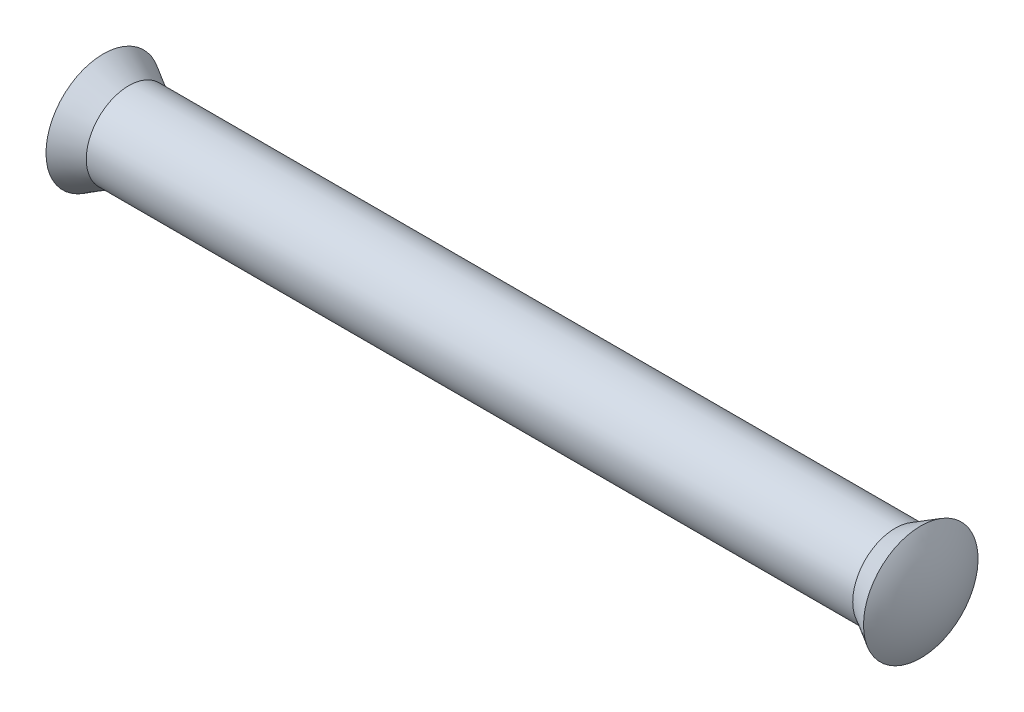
from build123d import *


with BuildPart() as part:
    # Sketch 1 → Revolve 1 (revolve)
    with BuildSketch(Plane.XY, mode=Mode.PRIVATE) as revolve_1_sk:
        with BuildLine():
            Line((0.999588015, 3.41988181), (2.523588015, 2.54))
            Line((2.523588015, 2.54), (48.294388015, 2.54))
            Line((48.294388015, 2.54), (49.818388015, 3.41988181))
            ThreePointArc((49.818388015, 3.41988181), (50.562958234, 1.781485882), (50.817976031, 0))
            Line((50.817976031, 0), (0, 0))
            ThreePointArc((0, 0), (0.255017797, 1.781485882), (0.999588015, 3.41988181))
        make_face()
    revolve(revolve_1_sk.sketch.rotate(Axis((0, 0, 0), (1, 0, 0)), 90), axis=Axis((0, 0, 0), (1, 0, 0)))


solid = part.part
